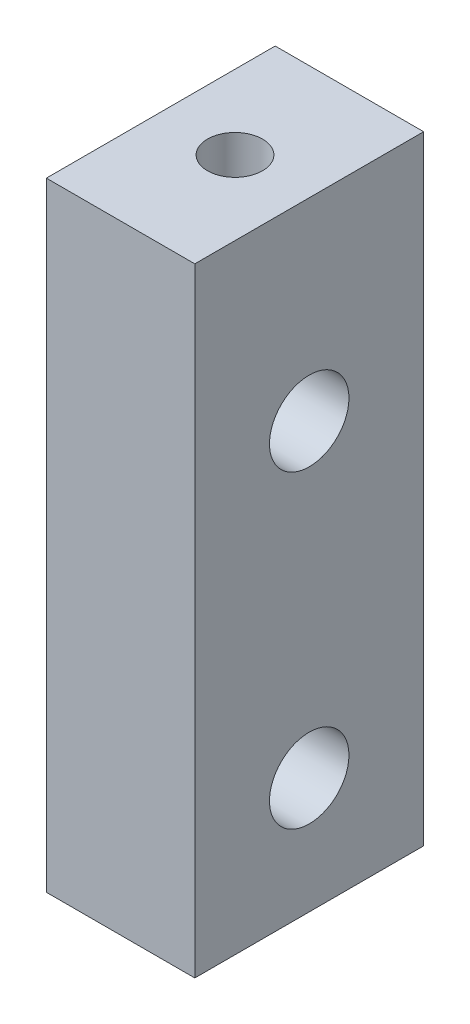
from build123d import *

# Parameters (mm, degrees)
SKETCH1_W                 = 9.398
SKETCH1_H                 = 25.4
EXTRUDE1_DEPTH            = 6.096
F_4_CLEARANCE_HOLE1_D     = 3.2639
F_4_CLEARANCE_HOLE1_DEPTH = 14.224
F_4_40_TAPPED_HOLE1_D     = 2.2606
F_4_40_TAPPED_HOLE1_DEPTH = 5.08
F_4_40_TAPPED_HOLE1_TIP   = 0.679152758


with BuildPart() as part:
    # Sketch1 → Extrude1 (new body)
    with BuildSketch(Plane(origin=(0, 0, 0), x_dir=(0, 0, -1), z_dir=(1, 0, 0))):
        with Locations((4.699, -12.7)):
            Rectangle(SKETCH1_W, SKETCH1_H)
    extrude(amount=EXTRUDE1_DEPTH)

    # 4 Clearance Hole1
    with Locations(Plane(origin=(6.096, 0, 0), x_dir=(0, 0, -1), z_dir=(1, 0, 0))):
        with Locations((4.699, -7.9375), (4.699, -20.6375)):
            Hole(F_4_CLEARANCE_HOLE1_D / 2, depth=F_4_CLEARANCE_HOLE1_DEPTH)

    # 4-40 Tapped Hole1
    with Locations(Plane(origin=(0, 0, 0), x_dir=(-1, 0, 0), z_dir=(0, 1, 0))):
        with Locations((-3.048, -4.699)):
            Hole(F_4_40_TAPPED_HOLE1_D / 2, depth=F_4_40_TAPPED_HOLE1_DEPTH)
            with Locations((0, 0, -(F_4_40_TAPPED_HOLE1_DEPTH + F_4_40_TAPPED_HOLE1_TIP / 2))):  # 118° drill point
                Cone(0, F_4_40_TAPPED_HOLE1_D / 2, F_4_40_TAPPED_HOLE1_TIP, mode=Mode.SUBTRACT)


solid = part.part
